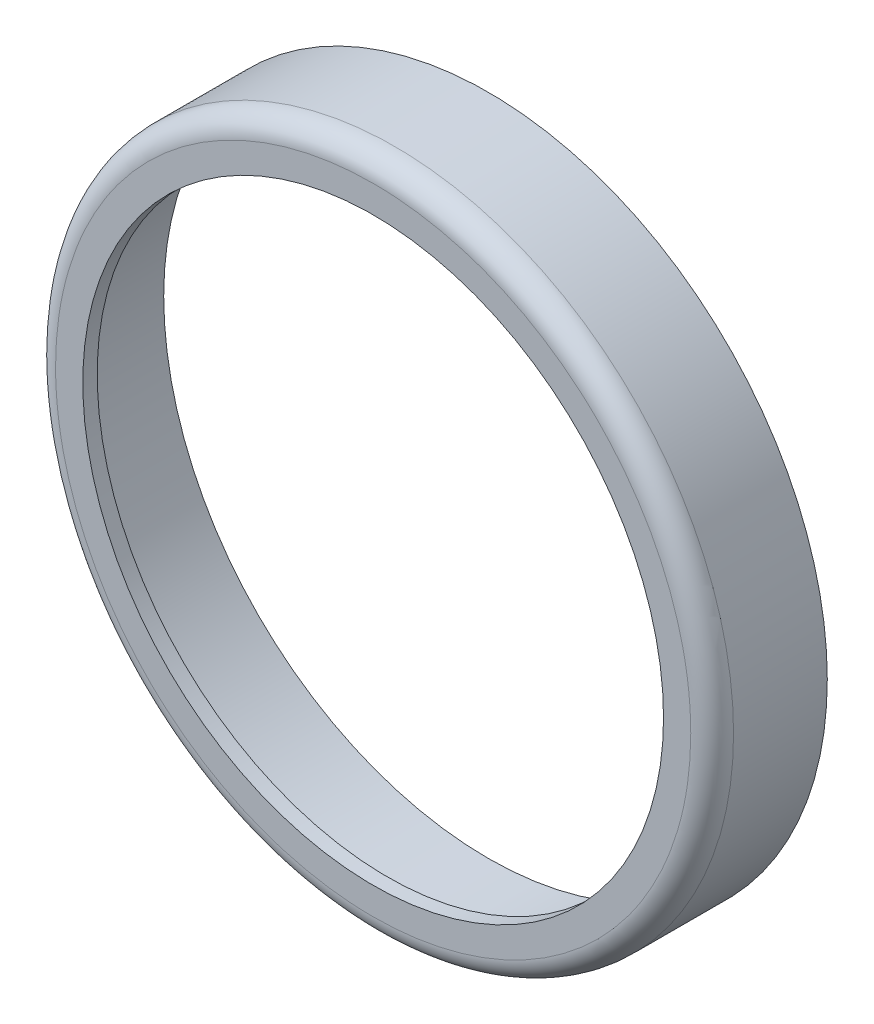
ISO-10303-21;
HEADER;
FILE_DESCRIPTION(('STEP AP214'),'2;1');
FILE_NAME('part.step','',(''),(''),'','','');
FILE_SCHEMA(('AUTOMOTIVE_DESIGN { 1 0 10303 214 1 1 1 1 }'));
ENDSEC;
DATA;
#1=APPLICATION_CONTEXT('core data for automotive mechanical design processes');
#2=APPLICATION_PROTOCOL_DEFINITION('international standard','automotive_design',2000,#1);
#3=PRODUCT_CONTEXT('',#1,'mechanical');
#4=PRODUCT('Part','Part','',(#3));
#5=PRODUCT_RELATED_PRODUCT_CATEGORY('part','',(#4));
#6=PRODUCT_DEFINITION_FORMATION('','',#4);
#7=PRODUCT_DEFINITION_CONTEXT('part definition',#1,'design');
#8=PRODUCT_DEFINITION('design','',#6,#7);
#9=PRODUCT_DEFINITION_SHAPE('','',#8);
#10=(LENGTH_UNIT() NAMED_UNIT(*) SI_UNIT(.MILLI.,.METRE.));
#11=(NAMED_UNIT(*) PLANE_ANGLE_UNIT() SI_UNIT($,.RADIAN.));
#12=(NAMED_UNIT(*) SI_UNIT($,.STERADIAN.) SOLID_ANGLE_UNIT());
#13=UNCERTAINTY_MEASURE_WITH_UNIT(LENGTH_MEASURE(1.E-05),#10,'distance_accuracy_value','');
#14=(GEOMETRIC_REPRESENTATION_CONTEXT(3) GLOBAL_UNCERTAINTY_ASSIGNED_CONTEXT((#13)) GLOBAL_UNIT_ASSIGNED_CONTEXT((#10,
#11,#12)) REPRESENTATION_CONTEXT('',''));
#15=CARTESIAN_POINT('',(0.,0.,0.));
#16=DIRECTION('',(0.,0.,1.));
#17=DIRECTION('',(1.,0.,0.));
#18=AXIS2_PLACEMENT_3D('',#15,#16,#17);
#19=CARTESIAN_POINT('',(0.,-18.9611,6.5786));
#20=DIRECTION('',(0.,0.,-1.));
#21=DIRECTION('',(-1.,0.,0.));
#22=AXIS2_PLACEMENT_3D('',#19,#20,#21);
#23=PLANE('',#22);
#24=CARTESIAN_POINT('',(0.,0.,6.57860000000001));
#25=DIRECTION('',(0.,0.,-1.));
#26=DIRECTION('',(-1.,0.,0.));
#27=AXIS2_PLACEMENT_3D('',#24,#25,#26);
#28=CIRCLE('',#27,20.4978);
#29=CARTESIAN_POINT('',(-20.4978,0.,6.57860000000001));
#30=VERTEX_POINT('',#29);
#31=EDGE_CURVE('E22',#30,#30,#28,.T.);
#32=ORIENTED_EDGE('',*,*,#31,.T.);
#33=EDGE_LOOP('',(#32));
#34=FACE_BOUND('',#33,.T.);
#35=CARTESIAN_POINT('',(0.,0.,6.5786));
#36=DIRECTION('',(0.,0.,1.));
#37=DIRECTION('',(1.,0.,0.));
#38=AXIS2_PLACEMENT_3D('',#35,#36,#37);
#39=CIRCLE('',#38,18.9611);
#40=CARTESIAN_POINT('',(18.9611,0.,6.5786));
#41=VERTEX_POINT('',#40);
#42=EDGE_CURVE('E58',#41,#41,#39,.T.);
#43=ORIENTED_EDGE('',*,*,#42,.T.);
#44=EDGE_LOOP('',(#43));
#45=FACE_BOUND('',#44,.T.);
#46=ADVANCED_FACE('F17',(#34,#45),#23,.T.);
#47=CARTESIAN_POINT('',(0.,0.,5.8801));
#48=DIRECTION('',(0.,0.,-1.));
#49=DIRECTION('',(-1.,0.,0.));
#50=AXIS2_PLACEMENT_3D('',#47,#48,#49);
#51=TOROIDAL_SURFACE('',#50,20.4978,0.698500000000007);
#52=CARTESIAN_POINT('',(0.,0.,5.88010000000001));
#53=DIRECTION('',(0.,0.,1.));
#54=DIRECTION('',(1.,0.,0.));
#55=AXIS2_PLACEMENT_3D('',#52,#53,#54);
#56=CIRCLE('',#55,21.1963);
#57=CARTESIAN_POINT('',(21.1963,0.,5.88010000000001));
#58=VERTEX_POINT('',#57);
#59=EDGE_CURVE('E57',#58,#58,#56,.F.);
#60=ORIENTED_EDGE('',*,*,#59,.T.);
#61=EDGE_LOOP('',(#60));
#62=FACE_BOUND('',#61,.T.);
#63=ORIENTED_EDGE('',*,*,#31,.F.);
#64=EDGE_LOOP('',(#63));
#65=FACE_BOUND('',#64,.T.);
#66=ADVANCED_FACE('F67',(#62,#65),#51,.F.);
#67=CARTESIAN_POINT('',(0.,0.,-57.));
#68=DIRECTION('',(0.,0.,1.));
#69=DIRECTION('',(1.,0.,0.));
#70=AXIS2_PLACEMENT_3D('',#67,#68,#69);
#71=CYLINDRICAL_SURFACE('',#70,18.9611);
#72=ORIENTED_EDGE('',*,*,#42,.F.);
#73=EDGE_LOOP('',(#72));
#74=FACE_BOUND('',#73,.T.);
#75=CARTESIAN_POINT('',(0.,0.,7.51840000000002));
#76=DIRECTION('',(0.,0.,1.));
#77=DIRECTION('',(1.,0.,0.));
#78=AXIS2_PLACEMENT_3D('',#75,#76,#77);
#79=CIRCLE('',#78,18.9611);
#80=CARTESIAN_POINT('',(18.9611,0.,7.51840000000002));
#81=VERTEX_POINT('',#80);
#82=EDGE_CURVE('E40',#81,#81,#79,.F.);
#83=ORIENTED_EDGE('',*,*,#82,.F.);
#84=EDGE_LOOP('',(#83));
#85=FACE_BOUND('',#84,.T.);
#86=ADVANCED_FACE('F69',(#74,#85),#71,.F.);
#87=CARTESIAN_POINT('',(0.,0.,-57.));
#88=DIRECTION('',(0.,0.,1.));
#89=DIRECTION('',(1.,0.,0.));
#90=AXIS2_PLACEMENT_3D('',#87,#88,#89);
#91=CYLINDRICAL_SURFACE('',#90,21.1963);
#92=ORIENTED_EDGE('',*,*,#59,.F.);
#93=EDGE_LOOP('',(#92));
#94=FACE_BOUND('',#93,.T.);
#95=CARTESIAN_POINT('',(0.,0.,0.));
#96=DIRECTION('',(0.,0.,1.));
#97=DIRECTION('',(1.,0.,0.));
#98=AXIS2_PLACEMENT_3D('',#95,#96,#97);
#99=CIRCLE('',#98,21.1963);
#100=CARTESIAN_POINT('',(21.1963,0.,0.));
#101=VERTEX_POINT('',#100);
#102=EDGE_CURVE('E39',#101,#101,#99,.T.);
#103=ORIENTED_EDGE('',*,*,#102,.F.);
#104=EDGE_LOOP('',(#103));
#105=FACE_BOUND('',#104,.T.);
#106=ADVANCED_FACE('F77',(#94,#105),#91,.F.);
#107=CARTESIAN_POINT('',(0.,-20.7391,7.5184));
#108=DIRECTION('',(0.,0.,1.));
#109=DIRECTION('',(1.,0.,0.));
#110=AXIS2_PLACEMENT_3D('',#107,#108,#109);
#111=PLANE('',#110);
#112=ORIENTED_EDGE('',*,*,#82,.T.);
#113=EDGE_LOOP('',(#112));
#114=FACE_BOUND('',#113,.T.);
#115=CARTESIAN_POINT('',(-20.7391,0.,7.5184));
#116=CARTESIAN_POINT('',(-20.7390937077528,0.404413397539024,7.51839999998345));
#117=CARTESIAN_POINT('',(-20.7272317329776,0.808824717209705,7.51839999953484));
#118=CARTESIAN_POINT('',(-20.6799006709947,1.61626276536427,7.51839999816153));
#119=CARTESIAN_POINT('',(-20.6444316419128,2.01928949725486,7.51839999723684));
#120=CARTESIAN_POINT('',(-20.5499908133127,2.82257917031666,7.51839999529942));
#121=CARTESIAN_POINT('',(-20.4910190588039,3.22284211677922,7.5183999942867));
#122=CARTESIAN_POINT('',(-20.3497791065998,4.01923573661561,7.51839999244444));
#123=CARTESIAN_POINT('',(-20.267510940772,4.41536641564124,7.5183999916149));
#124=CARTESIAN_POINT('',(-20.0799583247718,5.20214082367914,7.5183999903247));
#125=CARTESIAN_POINT('',(-19.9746738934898,5.59278455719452,7.51839998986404));
#126=CARTESIAN_POINT('',(-19.7414491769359,6.36724920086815,7.51839998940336));
#127=CARTESIAN_POINT('',(-19.6135088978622,6.75107011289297,7.51839998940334));
#128=CARTESIAN_POINT('',(-19.335409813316,7.51057672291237,7.51839998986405));
#129=CARTESIAN_POINT('',(-19.185251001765,7.88626241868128,7.51839999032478));
#130=CARTESIAN_POINT('',(-18.8632287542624,8.62821334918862,7.51839999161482));
#131=CARTESIAN_POINT('',(-18.6913653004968,8.99447857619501,7.51839999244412));
#132=CARTESIAN_POINT('',(-18.3265199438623,9.71633804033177,7.51839999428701));
#133=CARTESIAN_POINT('',(-18.1335380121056,10.0719322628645,7.5183999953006));
#134=CARTESIAN_POINT('',(-17.7271211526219,10.7712262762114,7.51839999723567));
#135=CARTESIAN_POINT('',(-17.5136861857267,11.1149260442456,7.51839999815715));
#136=CARTESIAN_POINT('',(-17.0670722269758,11.7892834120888,7.51839999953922));
#137=CARTESIAN_POINT('',(-16.8338931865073,12.1199409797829,7.51839999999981));
#138=CARTESIAN_POINT('',(-16.4719809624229,12.6025424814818,7.51840000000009));
#139=CARTESIAN_POINT('',(-16.3504008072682,12.7598989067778,7.51839999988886));
#140=CARTESIAN_POINT('',(-16.0972716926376,13.0779509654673,7.518399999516));
#141=CARTESIAN_POINT('',(-15.9655197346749,13.2384854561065,7.51839999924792));
#142=CARTESIAN_POINT('',(-15.6915607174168,13.5622512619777,7.51839999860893));
#143=CARTESIAN_POINT('',(-15.5491472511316,13.7253078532,7.51839999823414));
#144=CARTESIAN_POINT('',(-15.2533827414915,14.0534289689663,7.51839999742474));
#145=CARTESIAN_POINT('',(-15.0998224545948,14.2183049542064,7.51839999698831));
#146=CARTESIAN_POINT('',(-14.7812992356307,14.5493162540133,7.51839999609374));
#147=CARTESIAN_POINT('',(-14.6161252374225,14.7152485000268,7.5183999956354));
#148=CARTESIAN_POINT('',(-14.2739302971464,15.0475654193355,7.51839999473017));
#149=CARTESIAN_POINT('',(-14.0966974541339,15.2137319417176,7.51839999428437));
#150=CARTESIAN_POINT('',(-13.7299681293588,15.545649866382,7.51839999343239));
#151=CARTESIAN_POINT('',(-13.5402600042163,15.7111674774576,7.51839999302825));
#152=CARTESIAN_POINT('',(-13.1481974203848,16.0408586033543,7.51839999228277));
#153=CARTESIAN_POINT('',(-12.945632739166,16.2047821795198,7.51839999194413));
#154=CARTESIAN_POINT('',(-12.5275154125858,16.5302941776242,7.51839999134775));
#155=CARTESIAN_POINT('',(-12.31175521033,16.6916160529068,7.51839999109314));
#156=CARTESIAN_POINT('',(-11.8669536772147,17.0108714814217,7.51839999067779));
#157=CARTESIAN_POINT('',(-11.6377087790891,17.1685214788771,7.51839999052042));
#158=CARTESIAN_POINT('',(-11.1657009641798,17.4793184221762,7.51839999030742));
#159=CARTESIAN_POINT('',(-10.92273987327,17.6321644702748,7.51839999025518));
#160=CARTESIAN_POINT('',(-10.4231272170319,17.9321784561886,7.51839999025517));
#161=CARTESIAN_POINT('',(-10.166284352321,18.0790279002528,7.51839999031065));
#162=CARTESIAN_POINT('',(-9.6388086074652,18.3658152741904,7.51839999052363));
#163=CARTESIAN_POINT('',(-9.36799286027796,18.5054169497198,7.5183999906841));
#164=CARTESIAN_POINT('',(-8.81255347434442,18.7764198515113,7.51839999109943));
#165=CARTESIAN_POINT('',(-8.52775703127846,18.9074669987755,7.51839999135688));
#166=CARTESIAN_POINT('',(-7.94442900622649,19.1600201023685,7.5183999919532));
#167=CARTESIAN_POINT('',(-7.64573638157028,19.2811542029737,7.51839999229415));
#168=CARTESIAN_POINT('',(-7.03478847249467,19.5124933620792,7.51839999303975));
#169=CARTESIAN_POINT('',(-6.72238566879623,19.6223089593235,7.51839999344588));
#170=CARTESIAN_POINT('',(-6.08429879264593,19.8295819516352,7.51839999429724));
#171=CARTESIAN_POINT('',(-5.75848254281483,19.9266325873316,7.51839999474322));
#172=CARTESIAN_POINT('',(-5.09396811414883,20.1069119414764,7.51839999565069));
#173=CARTESIAN_POINT('',(-4.75515496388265,20.1897170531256,7.51839999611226));
#174=CARTESIAN_POINT('',(-4.06517334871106,20.3400157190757,7.518399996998));
#175=CARTESIAN_POINT('',(-3.71390902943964,20.4070694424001,7.51839999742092));
#176=CARTESIAN_POINT('',(-2.99968634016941,20.5243570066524,7.51839999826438));
#177=CARTESIAN_POINT('',(-2.63665313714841,20.5741355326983,7.5183999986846));
#178=CARTESIAN_POINT('',(-1.89970208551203,20.6553644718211,7.51839999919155));
#179=CARTESIAN_POINT('',(-1.5257324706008,20.6863452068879,7.51839999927));
#180=CARTESIAN_POINT('',(-0.767853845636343,20.728450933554,7.51840000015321));
#181=CARTESIAN_POINT('',(-0.383917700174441,20.739092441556,7.51840000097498));
#182=CARTESIAN_POINT('',(0.312727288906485,20.7391061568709,7.51839999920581));
#183=CARTESIAN_POINT('',(0.625442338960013,20.7320564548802,7.51839999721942));
#184=CARTESIAN_POINT('',(1.25025181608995,20.7038756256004,7.51839999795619));
#185=CARTESIAN_POINT('',(1.56234624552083,20.682744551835,7.51840000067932));
#186=CARTESIAN_POINT('',(2.03397319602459,20.6402090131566,7.51839992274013));
#187=CARTESIAN_POINT('',(2.19398349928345,20.6239218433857,7.51839988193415));
#188=CARTESIAN_POINT('',(2.64204649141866,20.5728596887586,7.51839983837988));
#189=CARTESIAN_POINT('',(2.92960831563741,20.5337490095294,7.51839989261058));
#190=CARTESIAN_POINT('',(3.70524175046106,20.411701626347,7.51839998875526));
#191=CARTESIAN_POINT('',(4.19158337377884,20.3173156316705,7.51839999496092));
#192=CARTESIAN_POINT('',(4.81785164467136,20.1723072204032,7.5183999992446));
#193=CARTESIAN_POINT('',(4.96156141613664,20.1374050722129,7.51839999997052));
#194=CARTESIAN_POINT('',(5.24821054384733,20.0645539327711,7.51839999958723));
#195=CARTESIAN_POINT('',(5.39114990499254,20.0266049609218,7.51839999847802));
#196=CARTESIAN_POINT('',(5.82708249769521,19.9058845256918,7.51839999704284));
#197=CARTESIAN_POINT('',(6.1187268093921,19.8181939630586,7.51839999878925));
#198=CARTESIAN_POINT('',(6.69789575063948,19.6301182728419,7.51840000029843));
#199=CARTESIAN_POINT('',(6.98542037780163,19.5297331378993,7.5184000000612));
#200=CARTESIAN_POINT('',(7.38466095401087,19.3804454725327,7.51839998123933));
#201=CARTESIAN_POINT('',(7.49835817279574,19.3367900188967,7.518399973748));
#202=CARTESIAN_POINT('',(7.72497126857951,19.247499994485,7.51839994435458));
#203=CARTESIAN_POINT('',(7.8378871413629,19.2018654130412,7.5183999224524));
#204=CARTESIAN_POINT('',(8.28649198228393,19.0159102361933,7.51839985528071));
#205=CARTESIAN_POINT('',(8.61895548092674,18.8676463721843,7.51839985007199));
#206=CARTESIAN_POINT('',(9.13459593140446,18.6206525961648,7.51839993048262));
#207=CARTESIAN_POINT('',(9.32068940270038,18.5279252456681,7.51839997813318));
#208=CARTESIAN_POINT('',(9.75809128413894,18.3020757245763,7.51840002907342));
#209=CARTESIAN_POINT('',(10.008212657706,18.1666397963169,7.51840000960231));
#210=CARTESIAN_POINT('',(10.4827512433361,17.8968648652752,7.51839998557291));
#211=CARTESIAN_POINT('',(10.7076169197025,17.7633150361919,7.51839997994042));
#212=CARTESIAN_POINT('',(11.0184771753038,17.5706207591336,7.51839996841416));
#213=CARTESIAN_POINT('',(11.1066813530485,17.5150168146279,7.5183999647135));
#214=CARTESIAN_POINT('',(11.3239692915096,17.3757144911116,7.51839996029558));
#215=CARTESIAN_POINT('',(11.4525492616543,17.2912287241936,7.51839996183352));
#216=CARTESIAN_POINT('',(11.8517107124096,17.0225361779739,7.51839996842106));
#217=CARTESIAN_POINT('',(12.1189253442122,16.8333065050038,7.51839997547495));
#218=CARTESIAN_POINT('',(12.7352872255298,16.3744965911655,7.51839999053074));
#219=CARTESIAN_POINT('',(13.08067104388,16.0998290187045,7.51839999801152));
#220=CARTESIAN_POINT('',(13.6030287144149,15.6565415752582,7.51840000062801));
#221=CARTESIAN_POINT('',(13.7863465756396,15.4953243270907,7.5183999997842));
#222=CARTESIAN_POINT('',(14.1472139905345,15.166541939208,7.51839999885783));
#223=CARTESIAN_POINT('',(14.3247635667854,14.9989768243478,7.51839999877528));
#224=CARTESIAN_POINT('',(14.6660886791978,14.6652851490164,7.51840000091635));
#225=CARTESIAN_POINT('',(14.830125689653,14.4994255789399,7.51840000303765));
#226=CARTESIAN_POINT('',(15.1525689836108,14.1623065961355,7.51839999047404));
#227=CARTESIAN_POINT('',(15.3109752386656,13.9910471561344,7.51839997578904));
#228=CARTESIAN_POINT('',(15.5241250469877,13.7525382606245,7.51839996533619));
#229=CARTESIAN_POINT('',(15.5814426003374,13.6875746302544,7.51839996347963));
#230=CARTESIAN_POINT('',(15.7619706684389,13.480348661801,7.51839995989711));
#231=CARTESIAN_POINT('',(15.883654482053,13.3367501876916,7.51839996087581));
#232=CARTESIAN_POINT('',(16.164420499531,12.9961242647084,7.51839996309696));
#233=CARTESIAN_POINT('',(16.3219006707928,12.7977762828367,7.5183999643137));
#234=CARTESIAN_POINT('',(16.6784553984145,12.3313911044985,7.51839996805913));
#235=CARTESIAN_POINT('',(16.8748140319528,12.0612677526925,7.51839997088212));
#236=CARTESIAN_POINT('',(17.1935068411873,11.5998272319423,7.51839997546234));
#237=CARTESIAN_POINT('',(17.3194157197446,11.4109636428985,7.51839997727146));
#238=CARTESIAN_POINT('',(17.5792096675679,11.0070592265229,7.51839998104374));
#239=CARTESIAN_POINT('',(17.7123263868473,10.7915226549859,7.51839998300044));
#240=CARTESIAN_POINT('',(17.9597678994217,10.373956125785,7.51839998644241));
#241=CARTESIAN_POINT('',(18.0747331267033,10.1723048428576,7.51839998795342));
#242=CARTESIAN_POINT('',(18.3127221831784,9.73808683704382,7.51839999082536));
#243=CARTESIAN_POINT('',(18.4347736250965,9.50498604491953,7.51839999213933));
#244=CARTESIAN_POINT('',(18.6662123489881,9.04173204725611,7.51839999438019));
#245=CARTESIAN_POINT('',(18.7758775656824,8.81171756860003,7.51839999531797));
#246=CARTESIAN_POINT('',(18.9832285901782,8.35535486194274,7.51839999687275));
#247=CARTESIAN_POINT('',(19.0811881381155,8.1291310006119,7.5183999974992));
#248=CARTESIAN_POINT('',(19.2658218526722,7.68100408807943,7.51839999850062));
#249=CARTESIAN_POINT('',(19.3527648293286,7.45921175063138,7.51839999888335));
#250=CARTESIAN_POINT('',(19.5160661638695,7.02053651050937,7.5183999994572));
#251=CARTESIAN_POINT('',(19.592687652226,6.80375153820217,7.51839999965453));
#252=CARTESIAN_POINT('',(19.7360475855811,6.37561927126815,7.51839999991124));
#253=CARTESIAN_POINT('',(19.8030428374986,6.16435791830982,7.51839999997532));
#254=CARTESIAN_POINT('',(19.9278490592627,5.74773971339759,7.51840000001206));
#255=CARTESIAN_POINT('',(19.9859099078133,5.54245776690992,7.51839999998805));
#256=CARTESIAN_POINT('',(20.0935367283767,5.13822198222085,7.51839999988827));
#257=CARTESIAN_POINT('',(20.1433452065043,4.93933240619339,7.51839999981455));
#258=CARTESIAN_POINT('',(20.2782046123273,4.36480182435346,7.51839999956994));
#259=CARTESIAN_POINT('',(20.3557775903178,3.98737400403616,7.51839999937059));
#260=CARTESIAN_POINT('',(20.4840138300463,3.26148049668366,7.51839999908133));
#261=CARTESIAN_POINT('',(20.5364191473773,2.91331963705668,7.51839999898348));
#262=CARTESIAN_POINT('',(20.6193484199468,2.24769654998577,7.51839999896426));
#263=CARTESIAN_POINT('',(20.6514689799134,1.93043314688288,7.51839999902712));
#264=CARTESIAN_POINT('',(20.6984745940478,1.32783849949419,7.51839999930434));
#265=CARTESIAN_POINT('',(20.7148051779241,1.04261929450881,7.51839999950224));
#266=CARTESIAN_POINT('',(20.7344680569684,0.50490192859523,7.51839999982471));
#267=CARTESIAN_POINT('',(20.7390896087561,0.252450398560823,7.51839999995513));
#268=CARTESIAN_POINT('',(20.7391,0.,7.5184));
#269=B_SPLINE_CURVE_WITH_KNOTS('',3,(#115,#116,#117,#118,#119,#120,#121,#122,#123,#124,#125,
#126,#127,#128,#129,#130,#131,#132,#133,#134,#135,#136,#137,#138,#139,#140,#141,#142,#143,#144,
#145,#146,#147,#148,#149,#150,#151,#152,#153,#154,#155,#156,#157,#158,#159,#160,#161,#162,#163,
#164,#165,#166,#167,#168,#169,#170,#171,#172,#173,#174,#175,#176,#177,#178,#179,#180,#181,#182,
#183,#184,#185,#186,#187,#188,#189,#190,#191,#192,#193,#194,#195,#196,#197,#198,#199,#200,#201,
#202,#203,#204,#205,#206,#207,#208,#209,#210,#211,#212,#213,#214,#215,#216,#217,#218,#219,#220,
#221,#222,#223,#224,#225,#226,#227,#228,#229,#230,#231,#232,#233,#234,#235,#236,#237,#238,#239,
#240,#241,#242,#243,#244,#245,#246,#247,#248,#249,#250,#251,#252,#253,#254,#255,#256,#257,#258,
#259,#260,#261,#262,#263,#264,#265,#266,#267,#268),.UNSPECIFIED.,.F.,.F.,(4,2,2,2,2,2,2,2,2,2,2,
2,2,2,2,2,2,2,2,2,2,2,2,2,2,2,2,2,2,2,2,2,2,2,2,2,2,2,2,2,2,2,2,2,2,2,2,2,2,2,2,2,2,2,2,2,2,2,2,
2,2,2,2,2,2,2,2,2,2,2,2,2,2,2,2,2,4),(0.,1.21306478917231,2.42612659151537,3.63918607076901,
4.85224389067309,6.06530071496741,7.27835720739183,8.49141403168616,9.70447185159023,
10.9175313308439,12.1305931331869,13.3436579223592,13.9401525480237,14.5630864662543,
15.2124594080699,15.8882710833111,16.5905211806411,17.3192093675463,18.074335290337,
18.8558985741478,19.6638988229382,20.4983356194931,21.3592085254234,22.2465170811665,
23.1602608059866,24.1004391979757,25.0670517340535,26.0600978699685,27.0795770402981,
28.1254886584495,29.1978321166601,30.2966067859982,31.4218120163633,32.5734471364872,
33.5115329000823,34.4496150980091,34.9320890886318,35.8024860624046,37.2872084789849,
37.7308527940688,38.1744942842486,39.0878131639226,40.0011325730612,40.3664869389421,
40.7318432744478,41.8232671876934,42.4469484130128,43.3000104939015,44.0844085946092,
44.3972031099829,44.8587244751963,45.8406594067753,47.1635059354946,47.8957530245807,
48.6279972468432,49.3277009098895,50.0274081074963,50.2873083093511,50.8518979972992,
51.611526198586,52.6129483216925,53.2937990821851,54.0536079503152,54.7498478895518,
55.5390134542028,56.3033013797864,57.0427115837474,57.7572439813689,58.4468984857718,
59.1116750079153,59.7515734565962,60.3665937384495,61.521887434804,62.5776938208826,
63.5340075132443,64.3908235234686,65.1481372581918),.UNSPECIFIED.);
#270=CARTESIAN_POINT('',(-20.7390999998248,-3.39589880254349E-06,7.5184));
#271=VERTEX_POINT('',#270);
#272=CARTESIAN_POINT('',(20.7390999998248,-3.39615597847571E-06,7.5184));
#273=VERTEX_POINT('',#272);
#274=EDGE_CURVE('E38',#271,#273,#269,.T.);
#275=ORIENTED_EDGE('',*,*,#274,.F.);
#276=CARTESIAN_POINT('',(20.7391,0.,7.5184));
#277=CARTESIAN_POINT('',(20.7390937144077,-0.404413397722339,7.51839999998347));
#278=CARTESIAN_POINT('',(20.7272317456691,-0.808824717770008,7.51839999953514));
#279=CARTESIAN_POINT('',(20.6799006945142,-1.61626276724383,7.51839999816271));
#280=CARTESIAN_POINT('',(20.6444316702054,-2.0192895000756,7.51839999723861));
#281=CARTESIAN_POINT('',(20.5499908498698,-2.82257917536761,7.51839999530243));
#282=CARTESIAN_POINT('',(20.4910190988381,-3.2228421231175,7.51839999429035));
#283=CARTESIAN_POINT('',(20.3497791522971,-4.01923574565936,7.51839999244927));
#284=CARTESIAN_POINT('',(20.2675109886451,-4.41536642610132,7.51839999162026));
#285=CARTESIAN_POINT('',(20.0799583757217,-5.20214083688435,7.51839999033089));
#286=CARTESIAN_POINT('',(19.9746739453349,-5.59278457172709,7.51839998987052));
#287=CARTESIAN_POINT('',(19.7414492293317,-6.36724921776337,7.51839998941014));
#288=CARTESIAN_POINT('',(19.6135089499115,-6.75107013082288,7.51839998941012));
#289=CARTESIAN_POINT('',(19.335409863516,-7.51057674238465,7.51839998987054));
#290=CARTESIAN_POINT('',(19.1852510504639,-7.88626243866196,7.51839999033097));
#291=CARTESIAN_POINT('',(18.8632287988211,-8.62821336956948,7.51839999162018));
#292=CARTESIAN_POINT('',(18.6913653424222,-8.99447859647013,7.51839999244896));
#293=CARTESIAN_POINT('',(18.3265199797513,-9.71633805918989,7.51839999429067));
#294=CARTESIAN_POINT('',(18.1335380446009,-10.0719322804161,7.5183999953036));
#295=CARTESIAN_POINT('',(17.7271211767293,-10.7712262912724,7.51839999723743));
#296=CARTESIAN_POINT('',(17.5136862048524,-11.1149260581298,7.51839999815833));
#297=CARTESIAN_POINT('',(17.0670722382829,-11.7892834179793,7.51839999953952));
#298=CARTESIAN_POINT('',(16.8338931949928,-12.1199409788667,7.51839999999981));
#299=CARTESIAN_POINT('',(16.4719573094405,-12.6025740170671,7.51840000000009));
#300=CARTESIAN_POINT('',(16.3503525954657,-12.7599612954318,7.51839999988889));
#301=CARTESIAN_POINT('',(16.0971749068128,-13.0780706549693,7.51839999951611));
#302=CARTESIAN_POINT('',(15.9653989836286,-13.2386316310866,7.51839999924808));
#303=CARTESIAN_POINT('',(15.6913927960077,-13.562446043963,7.51839999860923));
#304=CARTESIAN_POINT('',(15.548956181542,-13.7255248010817,7.51839999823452));
#305=CARTESIAN_POINT('',(15.2531463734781,-14.0536859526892,7.5183999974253));
#306=CARTESIAN_POINT('',(15.0995639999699,-14.2185798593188,7.51839999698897));
#307=CARTESIAN_POINT('',(14.7809978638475,-14.5496228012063,7.51839999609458));
#308=CARTESIAN_POINT('',(14.6158031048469,-14.7155688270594,7.51839999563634));
#309=CARTESIAN_POINT('',(14.2735681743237,-15.0479092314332,7.51839999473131));
#310=CARTESIAN_POINT('',(14.0963161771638,-15.2140855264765,7.5183999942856));
#311=CARTESIAN_POINT('',(13.7295503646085,-15.5460190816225,7.51839999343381));
#312=CARTESIAN_POINT('',(13.5398249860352,-15.7115426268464,7.51839999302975));
#313=CARTESIAN_POINT('',(13.1477300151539,-16.0412419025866,7.51839999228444));
#314=CARTESIAN_POINT('',(12.9451502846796,-16.2051677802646,7.51839999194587));
#315=CARTESIAN_POINT('',(12.5270052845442,-16.5306808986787,7.51839999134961));
#316=CARTESIAN_POINT('',(12.3112325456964,-16.6920016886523,7.51839999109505));
#317=CARTESIAN_POINT('',(11.8664086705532,-17.0112517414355,7.5183999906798));
#318=CARTESIAN_POINT('',(11.6371540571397,-17.1688975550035,7.51839999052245));
#319=CARTESIAN_POINT('',(11.165129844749,-17.4796832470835,7.5183999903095));
#320=CARTESIAN_POINT('',(10.9221621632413,-17.63252234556,7.51839999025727));
#321=CARTESIAN_POINT('',(10.4225396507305,-17.9325199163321,7.51839999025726));
#322=CARTESIAN_POINT('',(10.1656936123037,-18.079360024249,7.51839999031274));
#323=CARTESIAN_POINT('',(9.6382151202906,-18.3661266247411,7.51839999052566));
#324=CARTESIAN_POINT('',(9.36739989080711,-18.5057170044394,7.51839999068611));
#325=CARTESIAN_POINT('',(8.8119653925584,-18.7766956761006,7.51839999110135));
#326=CARTESIAN_POINT('',(8.52717340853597,-18.9077300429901,7.51839999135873));
#327=CARTESIAN_POINT('',(7.94385837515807,-19.1602564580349,7.51839999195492));
#328=CARTESIAN_POINT('',(7.64517436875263,-19.2813768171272,7.51839999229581));
#329=CARTESIAN_POINT('',(7.03424795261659,-19.512687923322,7.51839999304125));
#330=CARTESIAN_POINT('',(6.72185810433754,-19.6224893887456,7.51839999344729));
#331=CARTESIAN_POINT('',(6.08380153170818,-19.8297341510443,7.51839999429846));
#332=CARTESIAN_POINT('',(5.75800270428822,-19.9267708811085,7.51839999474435));
#333=CARTESIAN_POINT('',(5.09352759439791,-20.1070231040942,7.51839999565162));
#334=CARTESIAN_POINT('',(4.75473640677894,-20.1898151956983,7.5183999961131));
#335=CARTESIAN_POINT('',(4.06480320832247,-20.3400891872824,7.51839999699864));
#336=CARTESIAN_POINT('',(3.71356539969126,-20.4071314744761,7.51839999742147));
#337=CARTESIAN_POINT('',(2.99940016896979,-20.5243982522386,7.51839999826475));
#338=CARTESIAN_POINT('',(2.6363979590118,-20.574167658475,7.51839999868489));
#339=CARTESIAN_POINT('',(1.89951319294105,-20.6553811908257,7.51839999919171));
#340=CARTESIAN_POINT('',(1.52557890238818,-20.6863558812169,7.51839999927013));
#341=CARTESIAN_POINT('',(0.767775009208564,-20.7284531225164,7.51840000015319));
#342=CARTESIAN_POINT('',(0.383878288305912,-20.7390924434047,7.51840000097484));
#343=CARTESIAN_POINT('',(-0.312727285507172,-20.7391061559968,7.51839999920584));
#344=CARTESIAN_POINT('',(-0.62544233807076,-20.7320564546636,7.51839999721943));
#345=CARTESIAN_POINT('',(-1.25025181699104,-20.7038756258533,7.51839999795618));
#346=CARTESIAN_POINT('',(-1.56234624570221,-20.6827445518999,7.51840000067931));
#347=CARTESIAN_POINT('',(-2.03397319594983,-20.6402090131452,7.51839992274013));
#348=CARTESIAN_POINT('',(-2.19398349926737,-20.6239218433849,7.51839988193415));
#349=CARTESIAN_POINT('',(-2.64204649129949,-20.5728596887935,7.51839983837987));
#350=CARTESIAN_POINT('',(-2.92960831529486,-20.5337490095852,7.51839989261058));
#351=CARTESIAN_POINT('',(-3.70524175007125,-20.411701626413,7.51839998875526));
#352=CARTESIAN_POINT('',(-4.19158337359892,-20.317315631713,7.51839999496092));
#353=CARTESIAN_POINT('',(-4.81785164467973,-20.1723072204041,7.5183999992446));
#354=CARTESIAN_POINT('',(-4.9615614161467,-20.137405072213,7.51839999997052));
#355=CARTESIAN_POINT('',(-5.24821054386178,-20.0645539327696,7.51839999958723));
#356=CARTESIAN_POINT('',(-5.39114990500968,-20.0266049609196,7.51839999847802));
#357=CARTESIAN_POINT('',(-5.82708249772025,-19.9058845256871,7.51839999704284));
#358=CARTESIAN_POINT('',(-6.118726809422,-19.8181939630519,7.51839999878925));
#359=CARTESIAN_POINT('',(-6.69789575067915,-19.6301182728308,7.51840000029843));
#360=CARTESIAN_POINT('',(-6.98542037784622,-19.5297331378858,7.5184000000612));
#361=CARTESIAN_POINT('',(-7.38466095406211,-19.3804454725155,7.51839998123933));
#362=CARTESIAN_POINT('',(-7.49835817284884,-19.3367900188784,7.518399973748));
#363=CARTESIAN_POINT('',(-7.72497126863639,-19.2474999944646,7.51839994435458));
#364=CARTESIAN_POINT('',(-7.83788714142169,-19.2018654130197,7.5183999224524));
#365=CARTESIAN_POINT('',(-8.28649198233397,-19.0159102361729,7.51839985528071));
#366=CARTESIAN_POINT('',(-8.61895548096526,-18.8676463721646,7.51839985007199));
#367=CARTESIAN_POINT('',(-9.13459593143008,-18.6206525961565,7.51839993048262));
#368=CARTESIAN_POINT('',(-9.32068940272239,-18.527925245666,7.51839997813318));
#369=CARTESIAN_POINT('',(-9.75809128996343,-18.3020757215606,7.51840002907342));
#370=CARTESIAN_POINT('',(-10.0082126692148,-18.166639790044,7.51840000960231));
#371=CARTESIAN_POINT('',(-10.4827512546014,-17.8968648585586,7.51839998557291));
#372=CARTESIAN_POINT('',(-10.7076169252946,-17.7633150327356,7.51839997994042));
#373=CARTESIAN_POINT('',(-11.0184771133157,-17.5706207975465,7.51839996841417));
#374=CARTESIAN_POINT('',(-11.1066812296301,-17.5150168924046,7.51839996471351));
#375=CARTESIAN_POINT('',(-11.3239690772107,-17.3757146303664,7.5183999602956));
#376=CARTESIAN_POINT('',(-11.4525490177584,-17.2912288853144,7.51839996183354));
#377=CARTESIAN_POINT('',(-11.8517104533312,-17.0225363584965,7.51839996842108));
#378=CARTESIAN_POINT('',(-12.1189250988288,-16.8333066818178,7.51839997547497));
#379=CARTESIAN_POINT('',(-12.7352870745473,-16.3744967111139,7.51839999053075));
#380=CARTESIAN_POINT('',(-13.0806709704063,-16.0998290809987,7.51839999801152));
#381=CARTESIAN_POINT('',(-13.6030287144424,-15.6565415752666,7.51840000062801));
#382=CARTESIAN_POINT('',(-13.7863465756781,-15.4953243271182,7.5183999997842));
#383=CARTESIAN_POINT('',(-14.1472139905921,-15.1665419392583,7.51839999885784));
#384=CARTESIAN_POINT('',(-14.324763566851,-14.9989768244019,7.51839999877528));
#385=CARTESIAN_POINT('',(-14.6660886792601,-14.6652851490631,7.51840000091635));
#386=CARTESIAN_POINT('',(-14.8301256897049,-14.499425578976,7.51840000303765));
#387=CARTESIAN_POINT('',(-15.1525689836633,-14.1623065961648,7.51839999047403));
#388=CARTESIAN_POINT('',(-15.3109752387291,-13.9910471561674,7.51839997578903));
#389=CARTESIAN_POINT('',(-15.5241249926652,-13.7525383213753,7.51839996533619));
#390=CARTESIAN_POINT('',(-15.5814424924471,-13.6875747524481,7.51839996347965));
#391=CARTESIAN_POINT('',(-15.7619704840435,-13.4803488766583,7.51839995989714));
#392=CARTESIAN_POINT('',(-15.8836542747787,-13.3367504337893,7.51839996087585));
#393=CARTESIAN_POINT('',(-16.1644202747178,-12.9961245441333,7.51839996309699));
#394=CARTESIAN_POINT('',(-16.3219004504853,-12.7977765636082,7.51839996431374));
#395=CARTESIAN_POINT('',(-16.6784552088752,-12.331391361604,7.51839996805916));
#396=CARTESIAN_POINT('',(-16.874813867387,-12.0612679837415,7.51839997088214));
#397=CARTESIAN_POINT('',(-17.1935067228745,-11.5998274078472,7.51839997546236));
#398=CARTESIAN_POINT('',(-17.3194156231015,-11.4109637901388,7.51839997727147));
#399=CARTESIAN_POINT('',(-17.5792096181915,-11.0070593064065,7.51839998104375));
#400=CARTESIAN_POINT('',(-17.7123263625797,-10.7915226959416,7.51839998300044));
#401=CARTESIAN_POINT('',(-17.959774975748,-10.3739441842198,7.5183999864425));
#402=CARTESIAN_POINT('',(-18.0747468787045,-10.1722807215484,7.5183999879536));
#403=CARTESIAN_POINT('',(-18.3127487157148,-9.73803732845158,7.51839999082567));
#404=CARTESIAN_POINT('',(-18.4348061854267,-9.50492328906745,7.51839999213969));
#405=CARTESIAN_POINT('',(-18.6662551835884,-9.0416439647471,7.51839999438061));
#406=CARTESIAN_POINT('',(-18.7759247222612,-8.81161744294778,7.5183999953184));
#407=CARTESIAN_POINT('',(-18.9832828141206,-8.35523197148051,7.51839999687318));
#408=CARTESIAN_POINT('',(-19.0812451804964,-8.12899741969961,7.51839999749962));
#409=CARTESIAN_POINT('',(-19.2658831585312,-7.68085057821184,7.51839999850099));
#410=CARTESIAN_POINT('',(-19.3528276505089,-7.45904902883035,7.51839999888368));
#411=CARTESIAN_POINT('',(-19.5161308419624,-7.02035692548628,7.51839999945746));
#412=CARTESIAN_POINT('',(-19.5927527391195,-6.80356432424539,7.51839999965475));
#413=CARTESIAN_POINT('',(-19.7361125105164,-6.37541844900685,7.51839999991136));
#414=CARTESIAN_POINT('',(-19.8031072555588,-6.16415113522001,7.5183999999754));
#415=CARTESIAN_POINT('',(-19.9279116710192,-5.74752272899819,7.51840000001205));
#416=CARTESIAN_POINT('',(-19.9859712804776,-5.54223655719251,7.51839999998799));
#417=CARTESIAN_POINT('',(-20.0935950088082,-5.13799409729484,7.51839999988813));
#418=CARTESIAN_POINT('',(-20.1434016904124,-4.93910208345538,7.51839999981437));
#419=CARTESIAN_POINT('',(-20.2782545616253,-4.36456957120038,7.51839999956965));
#420=CARTESIAN_POINT('',(-20.3558229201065,-3.98714237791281,7.51839999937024));
#421=CARTESIAN_POINT('',(-20.4840491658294,-3.26125754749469,7.51839999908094));
#422=CARTESIAN_POINT('',(-20.5364494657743,-2.91310477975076,7.51839999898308));
#423=CARTESIAN_POINT('',(-20.6193690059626,-2.24750534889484,7.5183999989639));
#424=CARTESIAN_POINT('',(-20.651485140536,-1.93025752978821,7.5183999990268));
#425=CARTESIAN_POINT('',(-20.698483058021,-1.32770147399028,7.51839999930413));
#426=CARTESIAN_POINT('',(-20.7148105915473,-1.0425052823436,7.5183999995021));
#427=CARTESIAN_POINT('',(-20.7344691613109,-0.504841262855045,7.51839999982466));
#428=CARTESIAN_POINT('',(-20.7390896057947,-0.252420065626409,7.51839999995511));
#429=CARTESIAN_POINT('',(-20.7391,0.,7.5184));
#430=B_SPLINE_CURVE_WITH_KNOTS('',3,(#276,#277,#278,#279,#280,#281,#282,#283,#284,#285,#286,
#287,#288,#289,#290,#291,#292,#293,#294,#295,#296,#297,#298,#299,#300,#301,#302,#303,#304,#305,
#306,#307,#308,#309,#310,#311,#312,#313,#314,#315,#316,#317,#318,#319,#320,#321,#322,#323,#324,
#325,#326,#327,#328,#329,#330,#331,#332,#333,#334,#335,#336,#337,#338,#339,#340,#341,#342,#343,
#344,#345,#346,#347,#348,#349,#350,#351,#352,#353,#354,#355,#356,#357,#358,#359,#360,#361,#362,
#363,#364,#365,#366,#367,#368,#369,#370,#371,#372,#373,#374,#375,#376,#377,#378,#379,#380,#381,
#382,#383,#384,#385,#386,#387,#388,#389,#390,#391,#392,#393,#394,#395,#396,#397,#398,#399,#400,
#401,#402,#403,#404,#405,#406,#407,#408,#409,#410,#411,#412,#413,#414,#415,#416,#417,#418,#419,
#420,#421,#422,#423,#424,#425,#426,#427,#428,#429),.UNSPECIFIED.,.F.,.F.,(4,2,2,2,2,2,2,2,2,2,2,
2,2,2,2,2,2,2,2,2,2,2,2,2,2,2,2,2,2,2,2,2,2,2,2,2,2,2,2,2,2,2,2,2,2,2,2,2,2,2,2,2,2,2,2,2,2,2,2,
2,2,2,2,2,2,2,2,2,2,2,2,2,2,2,2,2,4),(0.,1.21306478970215,2.4261265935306,3.63918607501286,
4.8522438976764,6.0653007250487,7.27835722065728,8.49141404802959,9.70447187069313,
10.9175313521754,12.1305931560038,13.343657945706,13.9402708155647,14.5633117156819,
15.2127803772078,15.8886765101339,16.5909998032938,17.3197499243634,18.0749265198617,
18.8565292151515,19.6645576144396,20.4990113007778,21.3598898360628,22.2471927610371,
23.1609195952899,24.1010698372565,25.0676429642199,26.0606384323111,27.080055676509,
28.125894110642,29.1981531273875,30.2968320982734,31.421930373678,32.5734472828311,
33.5115330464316,34.4496152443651,34.9320892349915,35.8024862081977,37.2872086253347,
37.7308529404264,38.1744944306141,39.0878133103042,40.0011327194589,40.3664870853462,
40.7318434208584,41.8232673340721,42.4469485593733,43.3000106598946,44.0844087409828,
44.3972030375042,44.8587242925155,45.8406592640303,47.1635060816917,47.8957531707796,
48.6279973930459,49.3277010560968,50.0274082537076,50.2873082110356,50.8518977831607,
51.6115259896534,52.6129482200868,53.2937990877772,54.0536080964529,54.7498896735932,
55.5390988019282,56.3034248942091,57.042867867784,57.7574276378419,58.4471041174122,
59.1118972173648,59.7518068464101,60.3668329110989,61.5221219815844,62.5779021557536,
63.5341680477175,64.3909146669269,65.1481374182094),.UNSPECIFIED.);
#431=EDGE_CURVE('E34',#273,#271,#430,.T.);
#432=ORIENTED_EDGE('',*,*,#431,.F.);
#433=EDGE_LOOP('',(#275,#432));
#434=FACE_BOUND('',#433,.T.);
#435=ADVANCED_FACE('F37',(#114,#434),#111,.T.);
#436=CARTESIAN_POINT('',(0.,-22.1361,0.));
#437=DIRECTION('',(0.,0.,-1.));
#438=DIRECTION('',(-1.,0.,0.));
#439=AXIS2_PLACEMENT_3D('',#436,#437,#438);
#440=PLANE('',#439);
#441=CARTESIAN_POINT('',(0.,0.,0.));
#442=DIRECTION('',(0.,0.,1.));
#443=DIRECTION('',(1.,0.,0.));
#444=AXIS2_PLACEMENT_3D('',#441,#442,#443);
#445=CIRCLE('',#444,22.1361);
#446=CARTESIAN_POINT('',(22.1361,0.,0.));
#447=VERTEX_POINT('',#446);
#448=EDGE_CURVE('E27',#447,#447,#445,.T.);
#449=ORIENTED_EDGE('',*,*,#448,.F.);
#450=EDGE_LOOP('',(#449));
#451=FACE_BOUND('',#450,.T.);
#452=ORIENTED_EDGE('',*,*,#102,.T.);
#453=EDGE_LOOP('',(#452));
#454=FACE_BOUND('',#453,.T.);
#455=ADVANCED_FACE('F88',(#451,#454),#440,.T.);
#456=CARTESIAN_POINT('',(0.,0.,6.1214));
#457=DIRECTION('',(0.,0.,-1.));
#458=DIRECTION('',(-1.,0.,0.));
#459=AXIS2_PLACEMENT_3D('',#456,#457,#458);
#460=TOROIDAL_SURFACE('',#459,20.7391,1.397);
#461=CARTESIAN_POINT('',(0.,0.,6.12140000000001));
#462=DIRECTION('',(0.,0.,1.));
#463=DIRECTION('',(1.,0.,0.));
#464=AXIS2_PLACEMENT_3D('',#461,#462,#463);
#465=CIRCLE('',#464,22.1361);
#466=CARTESIAN_POINT('',(22.1361,0.,6.12140000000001));
#467=VERTEX_POINT('',#466);
#468=EDGE_CURVE('E11',#467,#467,#465,.F.);
#469=ORIENTED_EDGE('',*,*,#468,.F.);
#470=EDGE_LOOP('',(#469));
#471=FACE_BOUND('',#470,.T.);
#472=ORIENTED_EDGE('',*,*,#274,.T.);
#473=ORIENTED_EDGE('',*,*,#431,.T.);
#474=EDGE_LOOP('',(#472,#473));
#475=FACE_BOUND('',#474,.T.);
#476=ADVANCED_FACE('F19',(#471,#475),#460,.T.);
#477=CARTESIAN_POINT('',(0.,0.,-57.));
#478=DIRECTION('',(0.,0.,1.));
#479=DIRECTION('',(1.,0.,0.));
#480=AXIS2_PLACEMENT_3D('',#477,#478,#479);
#481=CYLINDRICAL_SURFACE('',#480,22.1361);
#482=ORIENTED_EDGE('',*,*,#468,.T.);
#483=EDGE_LOOP('',(#482));
#484=FACE_BOUND('',#483,.T.);
#485=ORIENTED_EDGE('',*,*,#448,.T.);
#486=EDGE_LOOP('',(#485));
#487=FACE_BOUND('',#486,.T.);
#488=ADVANCED_FACE('F81',(#484,#487),#481,.T.);
#489=CLOSED_SHELL('',(#46,#66,#86,#106,#435,#455,#476,#488));
#490=MANIFOLD_SOLID_BREP('B1',#489);
#491=ADVANCED_BREP_SHAPE_REPRESENTATION('',(#18,#490),#14);
#492=SHAPE_DEFINITION_REPRESENTATION(#9,#491);
ENDSEC;
END-ISO-10303-21;
